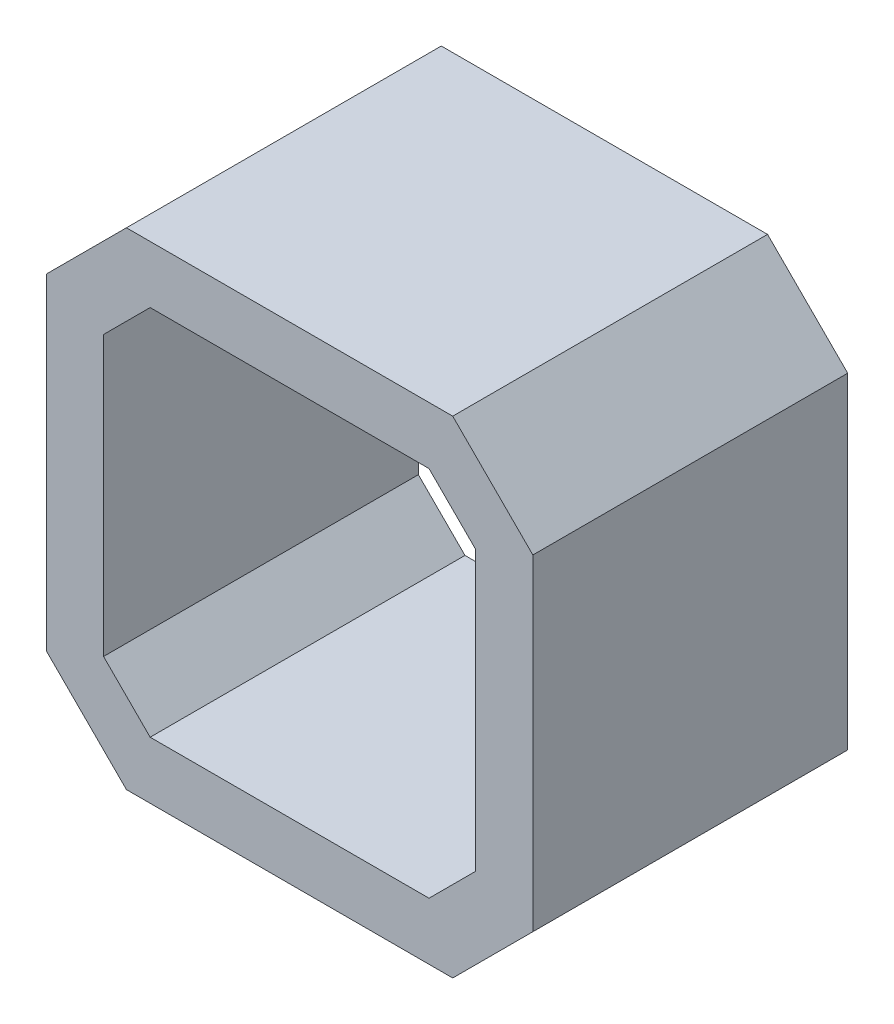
ISO-10303-21;
HEADER;
FILE_DESCRIPTION(('STEP AP214'),'2;1');
FILE_NAME('part.step','',(''),(''),'','','');
FILE_SCHEMA(('AUTOMOTIVE_DESIGN { 1 0 10303 214 1 1 1 1 }'));
ENDSEC;
DATA;
#1=APPLICATION_CONTEXT('core data for automotive mechanical design processes');
#2=APPLICATION_PROTOCOL_DEFINITION('international standard','automotive_design',2000,#1);
#3=PRODUCT_CONTEXT('',#1,'mechanical');
#4=PRODUCT('Part','Part','',(#3));
#5=PRODUCT_RELATED_PRODUCT_CATEGORY('part','',(#4));
#6=PRODUCT_DEFINITION_FORMATION('','',#4);
#7=PRODUCT_DEFINITION_CONTEXT('part definition',#1,'design');
#8=PRODUCT_DEFINITION('design','',#6,#7);
#9=PRODUCT_DEFINITION_SHAPE('','',#8);
#10=(LENGTH_UNIT() NAMED_UNIT(*) SI_UNIT(.MILLI.,.METRE.));
#11=(NAMED_UNIT(*) PLANE_ANGLE_UNIT() SI_UNIT($,.RADIAN.));
#12=(NAMED_UNIT(*) SI_UNIT($,.STERADIAN.) SOLID_ANGLE_UNIT());
#13=UNCERTAINTY_MEASURE_WITH_UNIT(LENGTH_MEASURE(1.E-05),#10,'distance_accuracy_value','');
#14=(GEOMETRIC_REPRESENTATION_CONTEXT(3) GLOBAL_UNCERTAINTY_ASSIGNED_CONTEXT((#13)) GLOBAL_UNIT_ASSIGNED_CONTEXT((#10,
#11,#12)) REPRESENTATION_CONTEXT('',''));
#15=CARTESIAN_POINT('',(0.,0.,0.));
#16=DIRECTION('',(0.,0.,1.));
#17=DIRECTION('',(1.,0.,0.));
#18=AXIS2_PLACEMENT_3D('',#15,#16,#17);
#19=CARTESIAN_POINT('',(0.,0.,27.5));
#20=DIRECTION('',(0.,0.,-1.));
#21=DIRECTION('',(-1.,0.,0.));
#22=AXIS2_PLACEMENT_3D('',#19,#20,#21);
#23=PLANE('',#22);
#24=DIRECTION('',(0.,-1.,0.));
#25=VECTOR('',#24,1.);
#26=CARTESIAN_POINT('',(-21.25,-14.25,27.5));
#27=LINE('',#26,#25);
#28=CARTESIAN_POINT('',(-21.25,14.25,27.5));
#29=VERTEX_POINT('',#28);
#30=CARTESIAN_POINT('',(-21.25,-14.25,27.5));
#31=VERTEX_POINT('',#30);
#32=EDGE_CURVE('E211',#29,#31,#27,.T.);
#33=ORIENTED_EDGE('',*,*,#32,.T.);
#34=DIRECTION('',(0.707106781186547,-0.707106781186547,0.));
#35=VECTOR('',#34,1.);
#36=CARTESIAN_POINT('',(-21.25,-14.25,27.5));
#37=LINE('',#36,#35);
#38=CARTESIAN_POINT('',(-14.25,-21.25,27.5));
#39=VERTEX_POINT('',#38);
#40=EDGE_CURVE('E214',#31,#39,#37,.T.);
#41=ORIENTED_EDGE('',*,*,#40,.T.);
#42=DIRECTION('',(1.,0.,0.));
#43=VECTOR('',#42,1.);
#44=CARTESIAN_POINT('',(-14.25,-21.25,27.5));
#45=LINE('',#44,#43);
#46=CARTESIAN_POINT('',(14.25,-21.25,27.5));
#47=VERTEX_POINT('',#46);
#48=EDGE_CURVE('E217',#39,#47,#45,.T.);
#49=ORIENTED_EDGE('',*,*,#48,.T.);
#50=DIRECTION('',(0.707106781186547,0.707106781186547,0.));
#51=VECTOR('',#50,1.);
#52=CARTESIAN_POINT('',(14.25,-21.25,27.5));
#53=LINE('',#52,#51);
#54=CARTESIAN_POINT('',(21.25,-14.25,27.5));
#55=VERTEX_POINT('',#54);
#56=EDGE_CURVE('E219',#47,#55,#53,.T.);
#57=ORIENTED_EDGE('',*,*,#56,.T.);
#58=DIRECTION('',(0.,1.,0.));
#59=VECTOR('',#58,1.);
#60=CARTESIAN_POINT('',(21.25,-14.25,27.5));
#61=LINE('',#60,#59);
#62=CARTESIAN_POINT('',(21.25,14.25,27.5));
#63=VERTEX_POINT('',#62);
#64=EDGE_CURVE('E221',#55,#63,#61,.T.);
#65=ORIENTED_EDGE('',*,*,#64,.T.);
#66=DIRECTION('',(-0.707106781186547,0.707106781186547,0.));
#67=VECTOR('',#66,1.);
#68=CARTESIAN_POINT('',(14.25,21.25,27.5));
#69=LINE('',#68,#67);
#70=CARTESIAN_POINT('',(14.25,21.25,27.5));
#71=VERTEX_POINT('',#70);
#72=EDGE_CURVE('E223',#63,#71,#69,.T.);
#73=ORIENTED_EDGE('',*,*,#72,.T.);
#74=DIRECTION('',(-1.,0.,0.));
#75=VECTOR('',#74,1.);
#76=CARTESIAN_POINT('',(-14.25,21.25,27.5));
#77=LINE('',#76,#75);
#78=CARTESIAN_POINT('',(-14.25,21.25,27.5));
#79=VERTEX_POINT('',#78);
#80=EDGE_CURVE('E225',#71,#79,#77,.T.);
#81=ORIENTED_EDGE('',*,*,#80,.T.);
#82=DIRECTION('',(-0.707106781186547,-0.707106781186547,0.));
#83=VECTOR('',#82,1.);
#84=CARTESIAN_POINT('',(-21.25,14.25,27.5));
#85=LINE('',#84,#83);
#86=EDGE_CURVE('E227',#79,#29,#85,.T.);
#87=ORIENTED_EDGE('',*,*,#86,.T.);
#88=EDGE_LOOP('',(#33,#41,#49,#57,#65,#73,#81,#87));
#89=FACE_BOUND('',#88,.T.);
#90=DIRECTION('',(-0.707106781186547,-0.707106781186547,0.));
#91=VECTOR('',#90,1.);
#92=CARTESIAN_POINT('',(-16.25,12.1789321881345,27.5));
#93=LINE('',#92,#91);
#94=CARTESIAN_POINT('',(-12.1789321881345,16.25,27.5));
#95=VERTEX_POINT('',#94);
#96=CARTESIAN_POINT('',(-16.25,12.1789321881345,27.5));
#97=VERTEX_POINT('',#96);
#98=EDGE_CURVE('E146',#95,#97,#93,.T.);
#99=ORIENTED_EDGE('',*,*,#98,.F.);
#100=DIRECTION('',(-1.,0.,0.));
#101=VECTOR('',#100,1.);
#102=CARTESIAN_POINT('',(-12.1789321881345,16.25,27.5));
#103=LINE('',#102,#101);
#104=CARTESIAN_POINT('',(12.1789321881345,16.25,27.5));
#105=VERTEX_POINT('',#104);
#106=EDGE_CURVE('E179',#105,#95,#103,.T.);
#107=ORIENTED_EDGE('',*,*,#106,.F.);
#108=DIRECTION('',(-0.707106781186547,0.707106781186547,0.));
#109=VECTOR('',#108,1.);
#110=CARTESIAN_POINT('',(12.1789321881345,16.25,27.5));
#111=LINE('',#110,#109);
#112=CARTESIAN_POINT('',(16.25,12.1789321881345,27.5));
#113=VERTEX_POINT('',#112);
#114=EDGE_CURVE('E177',#113,#105,#111,.T.);
#115=ORIENTED_EDGE('',*,*,#114,.F.);
#116=DIRECTION('',(0.,1.,0.));
#117=VECTOR('',#116,1.);
#118=CARTESIAN_POINT('',(16.25,-12.1789321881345,27.5));
#119=LINE('',#118,#117);
#120=CARTESIAN_POINT('',(16.25,-12.1789321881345,27.5));
#121=VERTEX_POINT('',#120);
#122=EDGE_CURVE('E175',#121,#113,#119,.T.);
#123=ORIENTED_EDGE('',*,*,#122,.F.);
#124=DIRECTION('',(0.707106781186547,0.707106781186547,0.));
#125=VECTOR('',#124,1.);
#126=CARTESIAN_POINT('',(12.1789321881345,-16.25,27.5));
#127=LINE('',#126,#125);
#128=CARTESIAN_POINT('',(12.1789321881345,-16.25,27.5));
#129=VERTEX_POINT('',#128);
#130=EDGE_CURVE('E173',#129,#121,#127,.T.);
#131=ORIENTED_EDGE('',*,*,#130,.F.);
#132=DIRECTION('',(1.,0.,0.));
#133=VECTOR('',#132,1.);
#134=CARTESIAN_POINT('',(-12.1789321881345,-16.25,27.5));
#135=LINE('',#134,#133);
#136=CARTESIAN_POINT('',(-12.1789321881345,-16.25,27.5));
#137=VERTEX_POINT('',#136);
#138=EDGE_CURVE('E169',#137,#129,#135,.T.);
#139=ORIENTED_EDGE('',*,*,#138,.F.);
#140=DIRECTION('',(0.707106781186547,-0.707106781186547,0.));
#141=VECTOR('',#140,1.);
#142=CARTESIAN_POINT('',(-16.25,-12.1789321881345,27.5));
#143=LINE('',#142,#141);
#144=CARTESIAN_POINT('',(-16.25,-12.1789321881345,27.5));
#145=VERTEX_POINT('',#144);
#146=EDGE_CURVE('E167',#145,#137,#143,.T.);
#147=ORIENTED_EDGE('',*,*,#146,.F.);
#148=DIRECTION('',(0.,-1.,0.));
#149=VECTOR('',#148,1.);
#150=CARTESIAN_POINT('',(-16.25,-12.1789321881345,27.5));
#151=LINE('',#150,#149);
#152=EDGE_CURVE('E154',#97,#145,#151,.T.);
#153=ORIENTED_EDGE('',*,*,#152,.F.);
#154=EDGE_LOOP('',(#99,#107,#115,#123,#131,#139,#147,#153));
#155=FACE_BOUND('',#154,.T.);
#156=ADVANCED_FACE('F33',(#89,#155),#23,.F.);
#157=CARTESIAN_POINT('',(0.,0.,0.));
#158=DIRECTION('',(0.,0.,-1.));
#159=DIRECTION('',(-1.,0.,0.));
#160=AXIS2_PLACEMENT_3D('',#157,#158,#159);
#161=PLANE('',#160);
#162=DIRECTION('',(0.,-1.,0.));
#163=VECTOR('',#162,1.);
#164=CARTESIAN_POINT('',(-21.25,-14.25,0.));
#165=LINE('',#164,#163);
#166=CARTESIAN_POINT('',(-21.25,14.25,0.));
#167=VERTEX_POINT('',#166);
#168=CARTESIAN_POINT('',(-21.25,-14.25,0.));
#169=VERTEX_POINT('',#168);
#170=EDGE_CURVE('E162',#167,#169,#165,.T.);
#171=ORIENTED_EDGE('',*,*,#170,.F.);
#172=DIRECTION('',(-0.707106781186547,-0.707106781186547,0.));
#173=VECTOR('',#172,1.);
#174=CARTESIAN_POINT('',(-21.25,14.25,0.));
#175=LINE('',#174,#173);
#176=CARTESIAN_POINT('',(-14.25,21.25,0.));
#177=VERTEX_POINT('',#176);
#178=EDGE_CURVE('E215',#177,#167,#175,.T.);
#179=ORIENTED_EDGE('',*,*,#178,.F.);
#180=DIRECTION('',(-1.,0.,0.));
#181=VECTOR('',#180,1.);
#182=CARTESIAN_POINT('',(-14.25,21.25,0.));
#183=LINE('',#182,#181);
#184=CARTESIAN_POINT('',(14.25,21.25,0.));
#185=VERTEX_POINT('',#184);
#186=EDGE_CURVE('E242',#185,#177,#183,.T.);
#187=ORIENTED_EDGE('',*,*,#186,.F.);
#188=DIRECTION('',(-0.707106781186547,0.707106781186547,0.));
#189=VECTOR('',#188,1.);
#190=CARTESIAN_POINT('',(14.25,21.25,0.));
#191=LINE('',#190,#189);
#192=CARTESIAN_POINT('',(21.25,14.25,0.));
#193=VERTEX_POINT('',#192);
#194=EDGE_CURVE('E240',#193,#185,#191,.T.);
#195=ORIENTED_EDGE('',*,*,#194,.F.);
#196=DIRECTION('',(0.,1.,0.));
#197=VECTOR('',#196,1.);
#198=CARTESIAN_POINT('',(21.25,-14.25,0.));
#199=LINE('',#198,#197);
#200=CARTESIAN_POINT('',(21.25,-14.25,0.));
#201=VERTEX_POINT('',#200);
#202=EDGE_CURVE('E238',#201,#193,#199,.T.);
#203=ORIENTED_EDGE('',*,*,#202,.F.);
#204=DIRECTION('',(0.707106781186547,0.707106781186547,0.));
#205=VECTOR('',#204,1.);
#206=CARTESIAN_POINT('',(14.25,-21.25,0.));
#207=LINE('',#206,#205);
#208=CARTESIAN_POINT('',(14.25,-21.25,0.));
#209=VERTEX_POINT('',#208);
#210=EDGE_CURVE('E236',#209,#201,#207,.T.);
#211=ORIENTED_EDGE('',*,*,#210,.F.);
#212=DIRECTION('',(1.,0.,0.));
#213=VECTOR('',#212,1.);
#214=CARTESIAN_POINT('',(-14.25,-21.25,0.));
#215=LINE('',#214,#213);
#216=CARTESIAN_POINT('',(-14.25,-21.25,0.));
#217=VERTEX_POINT('',#216);
#218=EDGE_CURVE('E234',#217,#209,#215,.T.);
#219=ORIENTED_EDGE('',*,*,#218,.F.);
#220=DIRECTION('',(0.707106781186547,-0.707106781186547,0.));
#221=VECTOR('',#220,1.);
#222=CARTESIAN_POINT('',(-21.25,-14.25,0.));
#223=LINE('',#222,#221);
#224=EDGE_CURVE('E232',#169,#217,#223,.T.);
#225=ORIENTED_EDGE('',*,*,#224,.F.);
#226=EDGE_LOOP('',(#171,#179,#187,#195,#203,#211,#219,#225));
#227=FACE_BOUND('',#226,.T.);
#228=DIRECTION('',(-1.,0.,0.));
#229=VECTOR('',#228,1.);
#230=CARTESIAN_POINT('',(-12.1789321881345,16.25,0.));
#231=LINE('',#230,#229);
#232=CARTESIAN_POINT('',(12.1789321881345,16.25,0.));
#233=VERTEX_POINT('',#232);
#234=CARTESIAN_POINT('',(-12.1789321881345,16.25,0.));
#235=VERTEX_POINT('',#234);
#236=EDGE_CURVE('E155',#233,#235,#231,.T.);
#237=ORIENTED_EDGE('',*,*,#236,.T.);
#238=DIRECTION('',(-0.707106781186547,-0.707106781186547,0.));
#239=VECTOR('',#238,1.);
#240=CARTESIAN_POINT('',(-16.25,12.1789321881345,0.));
#241=LINE('',#240,#239);
#242=CARTESIAN_POINT('',(-16.25,12.1789321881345,0.));
#243=VERTEX_POINT('',#242);
#244=EDGE_CURVE('E56',#235,#243,#241,.T.);
#245=ORIENTED_EDGE('',*,*,#244,.T.);
#246=DIRECTION('',(0.,-1.,0.));
#247=VECTOR('',#246,1.);
#248=CARTESIAN_POINT('',(-16.25,-12.1789321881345,0.));
#249=LINE('',#248,#247);
#250=CARTESIAN_POINT('',(-16.25,-12.1789321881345,0.));
#251=VERTEX_POINT('',#250);
#252=EDGE_CURVE('E161',#243,#251,#249,.T.);
#253=ORIENTED_EDGE('',*,*,#252,.T.);
#254=DIRECTION('',(0.707106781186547,-0.707106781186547,0.));
#255=VECTOR('',#254,1.);
#256=CARTESIAN_POINT('',(-16.25,-12.1789321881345,0.));
#257=LINE('',#256,#255);
#258=CARTESIAN_POINT('',(-12.1789321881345,-16.25,0.));
#259=VERTEX_POINT('',#258);
#260=EDGE_CURVE('E183',#251,#259,#257,.T.);
#261=ORIENTED_EDGE('',*,*,#260,.T.);
#262=DIRECTION('',(1.,0.,0.));
#263=VECTOR('',#262,1.);
#264=CARTESIAN_POINT('',(-12.1789321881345,-16.25,0.));
#265=LINE('',#264,#263);
#266=CARTESIAN_POINT('',(12.1789321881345,-16.25,0.));
#267=VERTEX_POINT('',#266);
#268=EDGE_CURVE('E186',#259,#267,#265,.T.);
#269=ORIENTED_EDGE('',*,*,#268,.T.);
#270=DIRECTION('',(0.707106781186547,0.707106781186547,0.));
#271=VECTOR('',#270,1.);
#272=CARTESIAN_POINT('',(12.1789321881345,-16.25,0.));
#273=LINE('',#272,#271);
#274=CARTESIAN_POINT('',(16.25,-12.1789321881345,0.));
#275=VERTEX_POINT('',#274);
#276=EDGE_CURVE('E189',#267,#275,#273,.T.);
#277=ORIENTED_EDGE('',*,*,#276,.T.);
#278=DIRECTION('',(0.,1.,0.));
#279=VECTOR('',#278,1.);
#280=CARTESIAN_POINT('',(16.25,-12.1789321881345,0.));
#281=LINE('',#280,#279);
#282=CARTESIAN_POINT('',(16.25,12.1789321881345,0.));
#283=VERTEX_POINT('',#282);
#284=EDGE_CURVE('E192',#275,#283,#281,.T.);
#285=ORIENTED_EDGE('',*,*,#284,.T.);
#286=DIRECTION('',(-0.707106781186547,0.707106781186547,0.));
#287=VECTOR('',#286,1.);
#288=CARTESIAN_POINT('',(12.1789321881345,16.25,0.));
#289=LINE('',#288,#287);
#290=EDGE_CURVE('E195',#283,#233,#289,.T.);
#291=ORIENTED_EDGE('',*,*,#290,.T.);
#292=EDGE_LOOP('',(#237,#245,#253,#261,#269,#277,#285,#291));
#293=FACE_BOUND('',#292,.T.);
#294=ADVANCED_FACE('F272',(#227,#293),#161,.T.);
#295=CARTESIAN_POINT('',(-21.25,-14.25,27.5));
#296=DIRECTION('',(1.,0.,0.));
#297=DIRECTION('',(0.,0.,-1.));
#298=AXIS2_PLACEMENT_3D('',#295,#296,#297);
#299=PLANE('',#298);
#300=ORIENTED_EDGE('',*,*,#170,.T.);
#301=DIRECTION('',(0.,0.,-1.));
#302=VECTOR('',#301,1.);
#303=CARTESIAN_POINT('',(-21.25,-14.25,27.5));
#304=LINE('',#303,#302);
#305=EDGE_CURVE('E11',#31,#169,#304,.T.);
#306=ORIENTED_EDGE('',*,*,#305,.F.);
#307=ORIENTED_EDGE('',*,*,#32,.F.);
#308=DIRECTION('',(0.,0.,-1.));
#309=VECTOR('',#308,1.);
#310=CARTESIAN_POINT('',(-21.25,14.25,27.5));
#311=LINE('',#310,#309);
#312=EDGE_CURVE('E229',#29,#167,#311,.T.);
#313=ORIENTED_EDGE('',*,*,#312,.T.);
#314=EDGE_LOOP('',(#300,#306,#307,#313));
#315=FACE_BOUND('',#314,.T.);
#316=ADVANCED_FACE('F35',(#315),#299,.F.);
#317=CARTESIAN_POINT('',(-21.25,-14.25,27.5));
#318=DIRECTION('',(0.707106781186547,0.707106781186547,0.));
#319=DIRECTION('',(-0.707106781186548,0.707106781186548,0.));
#320=AXIS2_PLACEMENT_3D('',#317,#318,#319);
#321=PLANE('',#320);
#322=ORIENTED_EDGE('',*,*,#224,.T.);
#323=DIRECTION('',(0.,0.,-1.));
#324=VECTOR('',#323,1.);
#325=CARTESIAN_POINT('',(-14.25,-21.25,27.5));
#326=LINE('',#325,#324);
#327=EDGE_CURVE('E41',#39,#217,#326,.T.);
#328=ORIENTED_EDGE('',*,*,#327,.F.);
#329=ORIENTED_EDGE('',*,*,#40,.F.);
#330=ORIENTED_EDGE('',*,*,#305,.T.);
#331=EDGE_LOOP('',(#322,#328,#329,#330));
#332=FACE_BOUND('',#331,.T.);
#333=ADVANCED_FACE('F289',(#332),#321,.F.);
#334=CARTESIAN_POINT('',(-14.25,-21.25,27.5));
#335=DIRECTION('',(0.,1.,0.));
#336=DIRECTION('',(0.,0.,1.));
#337=AXIS2_PLACEMENT_3D('',#334,#335,#336);
#338=PLANE('',#337);
#339=ORIENTED_EDGE('',*,*,#218,.T.);
#340=DIRECTION('',(0.,0.,-1.));
#341=VECTOR('',#340,1.);
#342=CARTESIAN_POINT('',(14.25,-21.25,27.5));
#343=LINE('',#342,#341);
#344=EDGE_CURVE('E259',#47,#209,#343,.T.);
#345=ORIENTED_EDGE('',*,*,#344,.F.);
#346=ORIENTED_EDGE('',*,*,#48,.F.);
#347=ORIENTED_EDGE('',*,*,#327,.T.);
#348=EDGE_LOOP('',(#339,#345,#346,#347));
#349=FACE_BOUND('',#348,.T.);
#350=ADVANCED_FACE('F266',(#349),#338,.F.);
#351=CARTESIAN_POINT('',(14.25,-21.25,27.5));
#352=DIRECTION('',(-0.707106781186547,0.707106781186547,0.));
#353=DIRECTION('',(-0.707106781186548,-0.707106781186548,0.));
#354=AXIS2_PLACEMENT_3D('',#351,#352,#353);
#355=PLANE('',#354);
#356=ORIENTED_EDGE('',*,*,#210,.T.);
#357=DIRECTION('',(0.,0.,-1.));
#358=VECTOR('',#357,1.);
#359=CARTESIAN_POINT('',(21.25,-14.25,27.5));
#360=LINE('',#359,#358);
#361=EDGE_CURVE('E256',#55,#201,#360,.T.);
#362=ORIENTED_EDGE('',*,*,#361,.F.);
#363=ORIENTED_EDGE('',*,*,#56,.F.);
#364=ORIENTED_EDGE('',*,*,#344,.T.);
#365=EDGE_LOOP('',(#356,#362,#363,#364));
#366=FACE_BOUND('',#365,.T.);
#367=ADVANCED_FACE('F278',(#366),#355,.F.);
#368=CARTESIAN_POINT('',(21.25,-14.25,27.5));
#369=DIRECTION('',(-1.,0.,0.));
#370=DIRECTION('',(0.,0.,1.));
#371=AXIS2_PLACEMENT_3D('',#368,#369,#370);
#372=PLANE('',#371);
#373=ORIENTED_EDGE('',*,*,#202,.T.);
#374=DIRECTION('',(0.,0.,-1.));
#375=VECTOR('',#374,1.);
#376=CARTESIAN_POINT('',(21.25,14.25,27.5));
#377=LINE('',#376,#375);
#378=EDGE_CURVE('E253',#63,#193,#377,.T.);
#379=ORIENTED_EDGE('',*,*,#378,.F.);
#380=ORIENTED_EDGE('',*,*,#64,.F.);
#381=ORIENTED_EDGE('',*,*,#361,.T.);
#382=EDGE_LOOP('',(#373,#379,#380,#381));
#383=FACE_BOUND('',#382,.T.);
#384=ADVANCED_FACE('F282',(#383),#372,.F.);
#385=CARTESIAN_POINT('',(14.25,21.25,27.5));
#386=DIRECTION('',(-0.707106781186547,-0.707106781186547,0.));
#387=DIRECTION('',(0.707106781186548,-0.707106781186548,0.));
#388=AXIS2_PLACEMENT_3D('',#385,#386,#387);
#389=PLANE('',#388);
#390=ORIENTED_EDGE('',*,*,#194,.T.);
#391=DIRECTION('',(0.,0.,-1.));
#392=VECTOR('',#391,1.);
#393=CARTESIAN_POINT('',(14.25,21.25,27.5));
#394=LINE('',#393,#392);
#395=EDGE_CURVE('E250',#71,#185,#394,.T.);
#396=ORIENTED_EDGE('',*,*,#395,.F.);
#397=ORIENTED_EDGE('',*,*,#72,.F.);
#398=ORIENTED_EDGE('',*,*,#378,.T.);
#399=EDGE_LOOP('',(#390,#396,#397,#398));
#400=FACE_BOUND('',#399,.T.);
#401=ADVANCED_FACE('F302',(#400),#389,.F.);
#402=CARTESIAN_POINT('',(-14.25,21.25,27.5));
#403=DIRECTION('',(0.,-1.,0.));
#404=DIRECTION('',(0.,0.,-1.));
#405=AXIS2_PLACEMENT_3D('',#402,#403,#404);
#406=PLANE('',#405);
#407=ORIENTED_EDGE('',*,*,#186,.T.);
#408=DIRECTION('',(0.,0.,-1.));
#409=VECTOR('',#408,1.);
#410=CARTESIAN_POINT('',(-14.25,21.25,27.5));
#411=LINE('',#410,#409);
#412=EDGE_CURVE('E247',#79,#177,#411,.T.);
#413=ORIENTED_EDGE('',*,*,#412,.F.);
#414=ORIENTED_EDGE('',*,*,#80,.F.);
#415=ORIENTED_EDGE('',*,*,#395,.T.);
#416=EDGE_LOOP('',(#407,#413,#414,#415));
#417=FACE_BOUND('',#416,.T.);
#418=ADVANCED_FACE('F300',(#417),#406,.F.);
#419=CARTESIAN_POINT('',(-21.25,14.25,27.5));
#420=DIRECTION('',(0.707106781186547,-0.707106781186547,0.));
#421=DIRECTION('',(0.707106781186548,0.707106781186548,0.));
#422=AXIS2_PLACEMENT_3D('',#419,#420,#421);
#423=PLANE('',#422);
#424=ORIENTED_EDGE('',*,*,#178,.T.);
#425=ORIENTED_EDGE('',*,*,#312,.F.);
#426=ORIENTED_EDGE('',*,*,#86,.F.);
#427=ORIENTED_EDGE('',*,*,#412,.T.);
#428=EDGE_LOOP('',(#424,#425,#426,#427));
#429=FACE_BOUND('',#428,.T.);
#430=ADVANCED_FACE('F295',(#429),#423,.F.);
#431=CARTESIAN_POINT('',(-16.25,12.1789321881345,27.5));
#432=DIRECTION('',(0.707106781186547,-0.707106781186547,0.));
#433=DIRECTION('',(0.707106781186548,0.707106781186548,0.));
#434=AXIS2_PLACEMENT_3D('',#431,#432,#433);
#435=PLANE('',#434);
#436=ORIENTED_EDGE('',*,*,#244,.F.);
#437=DIRECTION('',(0.,0.,-1.));
#438=VECTOR('',#437,1.);
#439=CARTESIAN_POINT('',(-12.1789321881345,16.25,27.5));
#440=LINE('',#439,#438);
#441=EDGE_CURVE('E150',#95,#235,#440,.T.);
#442=ORIENTED_EDGE('',*,*,#441,.F.);
#443=ORIENTED_EDGE('',*,*,#98,.T.);
#444=DIRECTION('',(0.,0.,-1.));
#445=VECTOR('',#444,1.);
#446=CARTESIAN_POINT('',(-16.25,12.1789321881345,27.5));
#447=LINE('',#446,#445);
#448=EDGE_CURVE('E149',#97,#243,#447,.T.);
#449=ORIENTED_EDGE('',*,*,#448,.T.);
#450=EDGE_LOOP('',(#436,#442,#443,#449));
#451=FACE_BOUND('',#450,.T.);
#452=ADVANCED_FACE('F148',(#451),#435,.T.);
#453=CARTESIAN_POINT('',(-16.25,-12.1789321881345,27.5));
#454=DIRECTION('',(1.,0.,0.));
#455=DIRECTION('',(0.,0.,-1.));
#456=AXIS2_PLACEMENT_3D('',#453,#454,#455);
#457=PLANE('',#456);
#458=ORIENTED_EDGE('',*,*,#252,.F.);
#459=ORIENTED_EDGE('',*,*,#448,.F.);
#460=ORIENTED_EDGE('',*,*,#152,.T.);
#461=DIRECTION('',(0.,0.,-1.));
#462=VECTOR('',#461,1.);
#463=CARTESIAN_POINT('',(-16.25,-12.1789321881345,27.5));
#464=LINE('',#463,#462);
#465=EDGE_CURVE('E163',#145,#251,#464,.T.);
#466=ORIENTED_EDGE('',*,*,#465,.T.);
#467=EDGE_LOOP('',(#458,#459,#460,#466));
#468=FACE_BOUND('',#467,.T.);
#469=ADVANCED_FACE('F158',(#468),#457,.T.);
#470=CARTESIAN_POINT('',(-16.25,-12.1789321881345,27.5));
#471=DIRECTION('',(0.707106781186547,0.707106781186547,0.));
#472=DIRECTION('',(-0.707106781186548,0.707106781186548,0.));
#473=AXIS2_PLACEMENT_3D('',#470,#471,#472);
#474=PLANE('',#473);
#475=ORIENTED_EDGE('',*,*,#260,.F.);
#476=ORIENTED_EDGE('',*,*,#465,.F.);
#477=ORIENTED_EDGE('',*,*,#146,.T.);
#478=DIRECTION('',(0.,0.,-1.));
#479=VECTOR('',#478,1.);
#480=CARTESIAN_POINT('',(-12.1789321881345,-16.25,27.5));
#481=LINE('',#480,#479);
#482=EDGE_CURVE('E208',#137,#259,#481,.T.);
#483=ORIENTED_EDGE('',*,*,#482,.T.);
#484=EDGE_LOOP('',(#475,#476,#477,#483));
#485=FACE_BOUND('',#484,.T.);
#486=ADVANCED_FACE('F327',(#485),#474,.T.);
#487=CARTESIAN_POINT('',(-12.1789321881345,-16.25,27.5));
#488=DIRECTION('',(0.,1.,0.));
#489=DIRECTION('',(0.,0.,1.));
#490=AXIS2_PLACEMENT_3D('',#487,#488,#489);
#491=PLANE('',#490);
#492=ORIENTED_EDGE('',*,*,#268,.F.);
#493=ORIENTED_EDGE('',*,*,#482,.F.);
#494=ORIENTED_EDGE('',*,*,#138,.T.);
#495=DIRECTION('',(0.,0.,-1.));
#496=VECTOR('',#495,1.);
#497=CARTESIAN_POINT('',(12.1789321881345,-16.25,27.5));
#498=LINE('',#497,#496);
#499=EDGE_CURVE('E206',#129,#267,#498,.T.);
#500=ORIENTED_EDGE('',*,*,#499,.T.);
#501=EDGE_LOOP('',(#492,#493,#494,#500));
#502=FACE_BOUND('',#501,.T.);
#503=ADVANCED_FACE('F331',(#502),#491,.T.);
#504=CARTESIAN_POINT('',(12.1789321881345,-16.25,27.5));
#505=DIRECTION('',(-0.707106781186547,0.707106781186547,0.));
#506=DIRECTION('',(-0.707106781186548,-0.707106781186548,0.));
#507=AXIS2_PLACEMENT_3D('',#504,#505,#506);
#508=PLANE('',#507);
#509=ORIENTED_EDGE('',*,*,#276,.F.);
#510=ORIENTED_EDGE('',*,*,#499,.F.);
#511=ORIENTED_EDGE('',*,*,#130,.T.);
#512=DIRECTION('',(0.,0.,-1.));
#513=VECTOR('',#512,1.);
#514=CARTESIAN_POINT('',(16.25,-12.1789321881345,27.5));
#515=LINE('',#514,#513);
#516=EDGE_CURVE('E204',#121,#275,#515,.T.);
#517=ORIENTED_EDGE('',*,*,#516,.T.);
#518=EDGE_LOOP('',(#509,#510,#511,#517));
#519=FACE_BOUND('',#518,.T.);
#520=ADVANCED_FACE('F337',(#519),#508,.T.);
#521=CARTESIAN_POINT('',(16.25,-12.1789321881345,27.5));
#522=DIRECTION('',(-1.,0.,0.));
#523=DIRECTION('',(0.,0.,1.));
#524=AXIS2_PLACEMENT_3D('',#521,#522,#523);
#525=PLANE('',#524);
#526=ORIENTED_EDGE('',*,*,#284,.F.);
#527=ORIENTED_EDGE('',*,*,#516,.F.);
#528=ORIENTED_EDGE('',*,*,#122,.T.);
#529=DIRECTION('',(0.,0.,-1.));
#530=VECTOR('',#529,1.);
#531=CARTESIAN_POINT('',(16.25,12.1789321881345,27.5));
#532=LINE('',#531,#530);
#533=EDGE_CURVE('E202',#113,#283,#532,.T.);
#534=ORIENTED_EDGE('',*,*,#533,.T.);
#535=EDGE_LOOP('',(#526,#527,#528,#534));
#536=FACE_BOUND('',#535,.T.);
#537=ADVANCED_FACE('F341',(#536),#525,.T.);
#538=CARTESIAN_POINT('',(12.1789321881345,16.25,27.5));
#539=DIRECTION('',(-0.707106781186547,-0.707106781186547,0.));
#540=DIRECTION('',(0.707106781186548,-0.707106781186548,0.));
#541=AXIS2_PLACEMENT_3D('',#538,#539,#540);
#542=PLANE('',#541);
#543=ORIENTED_EDGE('',*,*,#290,.F.);
#544=ORIENTED_EDGE('',*,*,#533,.F.);
#545=ORIENTED_EDGE('',*,*,#114,.T.);
#546=DIRECTION('',(0.,0.,-1.));
#547=VECTOR('',#546,1.);
#548=CARTESIAN_POINT('',(12.1789321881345,16.25,27.5));
#549=LINE('',#548,#547);
#550=EDGE_CURVE('E48',#105,#233,#549,.T.);
#551=ORIENTED_EDGE('',*,*,#550,.T.);
#552=EDGE_LOOP('',(#543,#544,#545,#551));
#553=FACE_BOUND('',#552,.T.);
#554=ADVANCED_FACE('F345',(#553),#542,.T.);
#555=CARTESIAN_POINT('',(-12.1789321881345,16.25,27.5));
#556=DIRECTION('',(0.,-1.,0.));
#557=DIRECTION('',(0.,0.,-1.));
#558=AXIS2_PLACEMENT_3D('',#555,#556,#557);
#559=PLANE('',#558);
#560=ORIENTED_EDGE('',*,*,#236,.F.);
#561=ORIENTED_EDGE('',*,*,#550,.F.);
#562=ORIENTED_EDGE('',*,*,#106,.T.);
#563=ORIENTED_EDGE('',*,*,#441,.T.);
#564=EDGE_LOOP('',(#560,#561,#562,#563));
#565=FACE_BOUND('',#564,.T.);
#566=ADVANCED_FACE('F349',(#565),#559,.T.);
#567=CLOSED_SHELL('',(#156,#294,#316,#333,#350,#367,#384,#401,#418,#430,#452,#469,#486,#503,
#520,#537,#554,#566));
#568=MANIFOLD_SOLID_BREP('B2',#567);
#569=ADVANCED_BREP_SHAPE_REPRESENTATION('',(#18,#568),#14);
#570=SHAPE_DEFINITION_REPRESENTATION(#9,#569);
ENDSEC;
END-ISO-10303-21;
